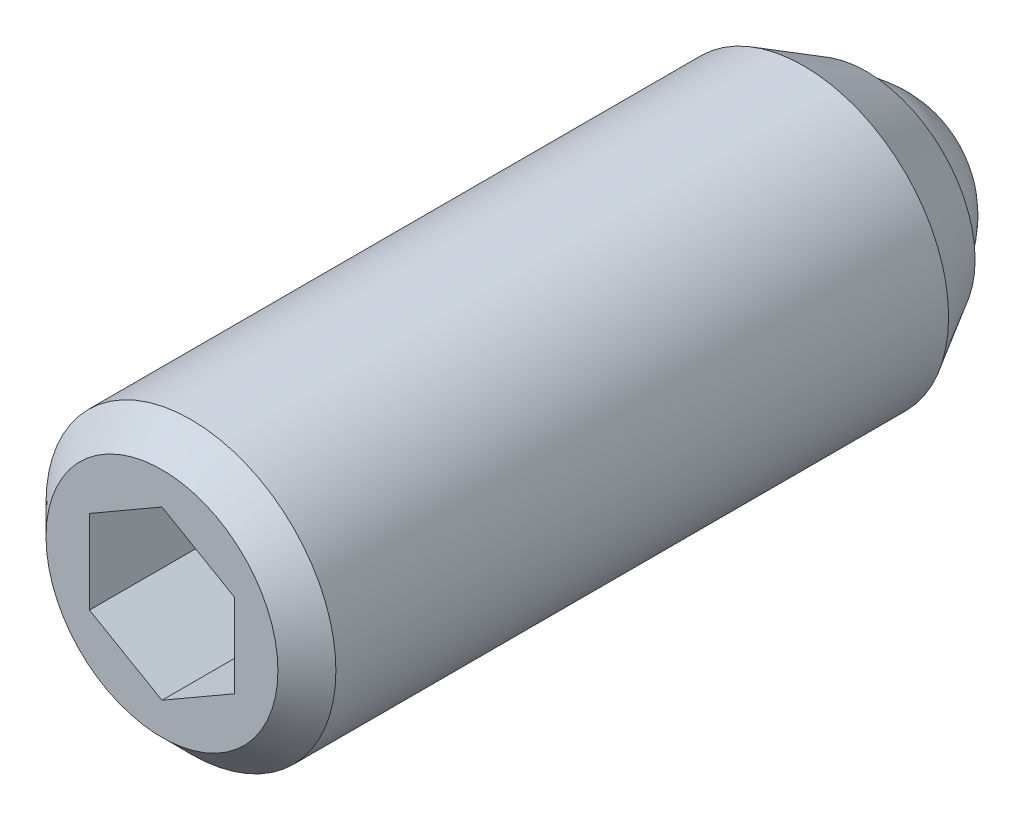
ISO-10303-21;
HEADER;
FILE_DESCRIPTION(('STEP AP214'),'2;1');
FILE_NAME('part.step','',(''),(''),'','','');
FILE_SCHEMA(('AUTOMOTIVE_DESIGN { 1 0 10303 214 1 1 1 1 }'));
ENDSEC;
DATA;
#1=APPLICATION_CONTEXT('core data for automotive mechanical design processes');
#2=APPLICATION_PROTOCOL_DEFINITION('international standard','automotive_design',2000,#1);
#3=PRODUCT_CONTEXT('',#1,'mechanical');
#4=PRODUCT('Part','Part','',(#3));
#5=PRODUCT_RELATED_PRODUCT_CATEGORY('part','',(#4));
#6=PRODUCT_DEFINITION_FORMATION('','',#4);
#7=PRODUCT_DEFINITION_CONTEXT('part definition',#1,'design');
#8=PRODUCT_DEFINITION('design','',#6,#7);
#9=PRODUCT_DEFINITION_SHAPE('','',#8);
#10=(LENGTH_UNIT() NAMED_UNIT(*) SI_UNIT(.MILLI.,.METRE.));
#11=(NAMED_UNIT(*) PLANE_ANGLE_UNIT() SI_UNIT($,.RADIAN.));
#12=(NAMED_UNIT(*) SI_UNIT($,.STERADIAN.) SOLID_ANGLE_UNIT());
#13=UNCERTAINTY_MEASURE_WITH_UNIT(LENGTH_MEASURE(1.E-05),#10,'distance_accuracy_value','');
#14=(GEOMETRIC_REPRESENTATION_CONTEXT(3) GLOBAL_UNCERTAINTY_ASSIGNED_CONTEXT((#13)) GLOBAL_UNIT_ASSIGNED_CONTEXT((#10,
#11,#12)) REPRESENTATION_CONTEXT('',''));
#15=CARTESIAN_POINT('',(0.,0.,0.));
#16=DIRECTION('',(0.,0.,1.));
#17=DIRECTION('',(1.,0.,0.));
#18=AXIS2_PLACEMENT_3D('',#15,#16,#17);
#19=CARTESIAN_POINT('',(2.5,1.44337567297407,24.2));
#20=DIRECTION('',(0.5,0.86602540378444,0.));
#21=DIRECTION('',(0.86602540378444,-0.5,0.));
#22=AXIS2_PLACEMENT_3D('',#19,#20,#21);
#23=PLANE('',#22);
#24=DIRECTION('',(0.,0.,1.));
#25=VECTOR('',#24,1.);
#26=CARTESIAN_POINT('',(2.5,1.44337567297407,24.2));
#27=LINE('',#26,#25);
#28=CARTESIAN_POINT('',(2.5,1.44337567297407,22.7));
#29=VERTEX_POINT('',#28);
#30=CARTESIAN_POINT('',(2.5,1.44337567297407,26.7));
#31=VERTEX_POINT('',#30);
#32=EDGE_CURVE('E68',#29,#31,#27,.T.);
#33=ORIENTED_EDGE('',*,*,#32,.T.);
#34=DIRECTION('',(-0.86602540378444,0.5,0.));
#35=VECTOR('',#34,1.);
#36=CARTESIAN_POINT('',(2.5,1.44337567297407,26.7));
#37=LINE('',#36,#35);
#38=CARTESIAN_POINT('',(0.,2.88675134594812,26.7));
#39=VERTEX_POINT('',#38);
#40=EDGE_CURVE('E29',#31,#39,#37,.T.);
#41=ORIENTED_EDGE('',*,*,#40,.T.);
#42=DIRECTION('',(0.,0.,1.));
#43=VECTOR('',#42,1.);
#44=CARTESIAN_POINT('',(0.,2.88675134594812,24.2));
#45=LINE('',#44,#43);
#46=CARTESIAN_POINT('',(0.,2.88675134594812,22.7));
#47=VERTEX_POINT('',#46);
#48=EDGE_CURVE('E80',#47,#39,#45,.T.);
#49=ORIENTED_EDGE('',*,*,#48,.F.);
#50=DIRECTION('',(-0.86602540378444,0.5,0.));
#51=VECTOR('',#50,1.);
#52=CARTESIAN_POINT('',(2.5,1.44337567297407,22.7));
#53=LINE('',#52,#51);
#54=EDGE_CURVE('E79',#29,#47,#53,.T.);
#55=ORIENTED_EDGE('',*,*,#54,.F.);
#56=EDGE_LOOP('',(#33,#41,#49,#55));
#57=FACE_BOUND('',#56,.T.);
#58=ADVANCED_FACE('F14',(#57),#23,.F.);
#59=CARTESIAN_POINT('',(2.5,-1.44337567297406,24.2));
#60=DIRECTION('',(1.,0.,0.));
#61=DIRECTION('',(0.,-1.,0.));
#62=AXIS2_PLACEMENT_3D('',#59,#60,#61);
#63=PLANE('',#62);
#64=DIRECTION('',(0.,0.,1.));
#65=VECTOR('',#64,1.);
#66=CARTESIAN_POINT('',(2.5,-1.44337567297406,24.2));
#67=LINE('',#66,#65);
#68=CARTESIAN_POINT('',(2.5,-1.44337567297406,22.7));
#69=VERTEX_POINT('',#68);
#70=CARTESIAN_POINT('',(2.5,-1.44337567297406,26.7));
#71=VERTEX_POINT('',#70);
#72=EDGE_CURVE('E76',#69,#71,#67,.T.);
#73=ORIENTED_EDGE('',*,*,#72,.T.);
#74=DIRECTION('',(0.,1.,0.));
#75=VECTOR('',#74,1.);
#76=CARTESIAN_POINT('',(2.5,-1.44337567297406,26.7));
#77=LINE('',#76,#75);
#78=EDGE_CURVE('E75',#71,#31,#77,.T.);
#79=ORIENTED_EDGE('',*,*,#78,.T.);
#80=ORIENTED_EDGE('',*,*,#32,.F.);
#81=DIRECTION('',(0.,1.,0.));
#82=VECTOR('',#81,1.);
#83=CARTESIAN_POINT('',(2.5,-1.44337567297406,22.7));
#84=LINE('',#83,#82);
#85=EDGE_CURVE('E72',#69,#29,#84,.T.);
#86=ORIENTED_EDGE('',*,*,#85,.F.);
#87=EDGE_LOOP('',(#73,#79,#80,#86));
#88=FACE_BOUND('',#87,.T.);
#89=ADVANCED_FACE('F70',(#88),#63,.F.);
#90=CARTESIAN_POINT('',(2.5,-1.44337567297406,24.2));
#91=DIRECTION('',(-0.5,0.866025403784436,0.));
#92=DIRECTION('',(0.866025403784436,0.5,0.));
#93=AXIS2_PLACEMENT_3D('',#90,#91,#92);
#94=PLANE('',#93);
#95=DIRECTION('',(0.,0.,1.));
#96=VECTOR('',#95,1.);
#97=CARTESIAN_POINT('',(0.,-2.88675134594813,24.2));
#98=LINE('',#97,#96);
#99=CARTESIAN_POINT('',(0.,-2.88675134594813,22.7));
#100=VERTEX_POINT('',#99);
#101=CARTESIAN_POINT('',(0.,-2.88675134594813,26.7));
#102=VERTEX_POINT('',#101);
#103=EDGE_CURVE('E122',#100,#102,#98,.T.);
#104=ORIENTED_EDGE('',*,*,#103,.T.);
#105=DIRECTION('',(-0.866025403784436,-0.5,0.));
#106=VECTOR('',#105,1.);
#107=CARTESIAN_POINT('',(2.5,-1.44337567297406,26.7));
#108=LINE('',#107,#106);
#109=EDGE_CURVE('E113',#71,#102,#108,.T.);
#110=ORIENTED_EDGE('',*,*,#109,.F.);
#111=ORIENTED_EDGE('',*,*,#72,.F.);
#112=DIRECTION('',(0.866025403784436,0.5,0.));
#113=VECTOR('',#112,1.);
#114=CARTESIAN_POINT('',(0.,-2.88675134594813,22.7));
#115=LINE('',#114,#113);
#116=EDGE_CURVE('E89',#100,#69,#115,.T.);
#117=ORIENTED_EDGE('',*,*,#116,.F.);
#118=EDGE_LOOP('',(#104,#110,#111,#117));
#119=FACE_BOUND('',#118,.T.);
#120=ADVANCED_FACE('F147',(#119),#94,.T.);
#121=CARTESIAN_POINT('',(-2.5,-1.44337567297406,24.2));
#122=DIRECTION('',(-0.5,-0.866025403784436,0.));
#123=DIRECTION('',(-0.866025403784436,0.5,0.));
#124=AXIS2_PLACEMENT_3D('',#121,#122,#123);
#125=PLANE('',#124);
#126=DIRECTION('',(0.,0.,1.));
#127=VECTOR('',#126,1.);
#128=CARTESIAN_POINT('',(-2.5,-1.44337567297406,24.2));
#129=LINE('',#128,#127);
#130=CARTESIAN_POINT('',(-2.5,-1.44337567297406,22.7));
#131=VERTEX_POINT('',#130);
#132=CARTESIAN_POINT('',(-2.5,-1.44337567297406,26.7));
#133=VERTEX_POINT('',#132);
#134=EDGE_CURVE('E120',#131,#133,#129,.T.);
#135=ORIENTED_EDGE('',*,*,#134,.T.);
#136=DIRECTION('',(0.866025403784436,-0.5,0.));
#137=VECTOR('',#136,1.);
#138=CARTESIAN_POINT('',(-2.5,-1.44337567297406,26.7));
#139=LINE('',#138,#137);
#140=EDGE_CURVE('E111',#133,#102,#139,.T.);
#141=ORIENTED_EDGE('',*,*,#140,.T.);
#142=ORIENTED_EDGE('',*,*,#103,.F.);
#143=DIRECTION('',(0.866025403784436,-0.5,0.));
#144=VECTOR('',#143,1.);
#145=CARTESIAN_POINT('',(-2.5,-1.44337567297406,22.7));
#146=LINE('',#145,#144);
#147=EDGE_CURVE('E101',#131,#100,#146,.T.);
#148=ORIENTED_EDGE('',*,*,#147,.F.);
#149=EDGE_LOOP('',(#135,#141,#142,#148));
#150=FACE_BOUND('',#149,.T.);
#151=ADVANCED_FACE('F157',(#150),#125,.F.);
#152=CARTESIAN_POINT('',(-2.5,-1.44337567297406,24.2));
#153=DIRECTION('',(1.,0.,0.));
#154=DIRECTION('',(0.,-1.,0.));
#155=AXIS2_PLACEMENT_3D('',#152,#153,#154);
#156=PLANE('',#155);
#157=DIRECTION('',(0.,0.,1.));
#158=VECTOR('',#157,1.);
#159=CARTESIAN_POINT('',(-2.5,1.44337567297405,24.2));
#160=LINE('',#159,#158);
#161=CARTESIAN_POINT('',(-2.5,1.44337567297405,22.7));
#162=VERTEX_POINT('',#161);
#163=CARTESIAN_POINT('',(-2.5,1.44337567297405,26.7));
#164=VERTEX_POINT('',#163);
#165=EDGE_CURVE('E37',#162,#164,#160,.T.);
#166=ORIENTED_EDGE('',*,*,#165,.T.);
#167=DIRECTION('',(0.,1.,0.));
#168=VECTOR('',#167,1.);
#169=CARTESIAN_POINT('',(-2.5,-1.44337567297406,26.7));
#170=LINE('',#169,#168);
#171=EDGE_CURVE('E108',#133,#164,#170,.T.);
#172=ORIENTED_EDGE('',*,*,#171,.F.);
#173=ORIENTED_EDGE('',*,*,#134,.F.);
#174=DIRECTION('',(0.,-1.,0.));
#175=VECTOR('',#174,1.);
#176=CARTESIAN_POINT('',(-2.5,1.44337567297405,22.7));
#177=LINE('',#176,#175);
#178=EDGE_CURVE('E98',#162,#131,#177,.T.);
#179=ORIENTED_EDGE('',*,*,#178,.F.);
#180=EDGE_LOOP('',(#166,#172,#173,#179));
#181=FACE_BOUND('',#180,.T.);
#182=ADVANCED_FACE('F153',(#181),#156,.T.);
#183=CARTESIAN_POINT('',(-2.5,1.44337567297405,24.2));
#184=DIRECTION('',(0.5,-0.866025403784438,0.));
#185=DIRECTION('',(-0.866025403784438,-0.5,0.));
#186=AXIS2_PLACEMENT_3D('',#183,#184,#185);
#187=PLANE('',#186);
#188=ORIENTED_EDGE('',*,*,#165,.F.);
#189=DIRECTION('',(-0.866025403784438,-0.5,0.));
#190=VECTOR('',#189,1.);
#191=CARTESIAN_POINT('',(0.,2.88675134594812,22.7));
#192=LINE('',#191,#190);
#193=EDGE_CURVE('E84',#47,#162,#192,.T.);
#194=ORIENTED_EDGE('',*,*,#193,.F.);
#195=ORIENTED_EDGE('',*,*,#48,.T.);
#196=DIRECTION('',(0.866025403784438,0.5,0.));
#197=VECTOR('',#196,1.);
#198=CARTESIAN_POINT('',(-2.5,1.44337567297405,26.7));
#199=LINE('',#198,#197);
#200=EDGE_CURVE('E105',#164,#39,#199,.T.);
#201=ORIENTED_EDGE('',*,*,#200,.F.);
#202=EDGE_LOOP('',(#188,#194,#195,#201));
#203=FACE_BOUND('',#202,.T.);
#204=ADVANCED_FACE('F150',(#203),#187,.T.);
#205=CARTESIAN_POINT('',(0.,0.,26.45));
#206=DIRECTION('',(0.,0.,-1.));
#207=DIRECTION('',(1.,0.,0.));
#208=AXIS2_PLACEMENT_3D('',#205,#206,#207);
#209=CYLINDRICAL_SURFACE('',#208,5.);
#210=CARTESIAN_POINT('',(0.,0.,25.7));
#211=DIRECTION('',(0.,0.,-1.));
#212=DIRECTION('',(1.,0.,0.));
#213=AXIS2_PLACEMENT_3D('',#210,#211,#212);
#214=CIRCLE('',#213,5.);
#215=CARTESIAN_POINT('',(5.,0.,25.7));
#216=VERTEX_POINT('',#215);
#217=EDGE_CURVE('E9',#216,#216,#214,.T.);
#218=ORIENTED_EDGE('',*,*,#217,.T.);
#219=EDGE_LOOP('',(#218));
#220=FACE_BOUND('',#219,.T.);
#221=CARTESIAN_POINT('',(0.,0.,4.56506350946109));
#222=DIRECTION('',(0.,0.,-1.));
#223=DIRECTION('',(-1.,0.,0.));
#224=AXIS2_PLACEMENT_3D('',#221,#222,#223);
#225=CIRCLE('',#224,5.);
#226=CARTESIAN_POINT('',(-5.,0.,4.56506350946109));
#227=VERTEX_POINT('',#226);
#228=EDGE_CURVE('E244',#227,#227,#225,.T.);
#229=ORIENTED_EDGE('',*,*,#228,.F.);
#230=EDGE_LOOP('',(#229));
#231=FACE_BOUND('',#230,.T.);
#232=ADVANCED_FACE('F16',(#220,#231),#209,.T.);
#233=CARTESIAN_POINT('',(0.,0.,25.7));
#234=DIRECTION('',(0.,0.,-1.));
#235=DIRECTION('',(1.,0.,0.));
#236=AXIS2_PLACEMENT_3D('',#233,#234,#235);
#237=CONICAL_SURFACE('',#236,5.,0.785398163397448);
#238=CARTESIAN_POINT('',(0.,0.,26.7));
#239=DIRECTION('',(0.,0.,-1.));
#240=DIRECTION('',(1.,0.,0.));
#241=AXIS2_PLACEMENT_3D('',#238,#239,#240);
#242=CIRCLE('',#241,4.);
#243=CARTESIAN_POINT('',(4.,0.,26.7));
#244=VERTEX_POINT('',#243);
#245=EDGE_CURVE('E22',#244,#244,#242,.T.);
#246=ORIENTED_EDGE('',*,*,#245,.T.);
#247=EDGE_LOOP('',(#246));
#248=FACE_BOUND('',#247,.T.);
#249=ORIENTED_EDGE('',*,*,#217,.F.);
#250=EDGE_LOOP('',(#249));
#251=FACE_BOUND('',#250,.T.);
#252=ADVANCED_FACE('F127',(#248,#251),#237,.T.);
#253=CARTESIAN_POINT('',(0.,0.,26.7));
#254=DIRECTION('',(0.,0.,-1.));
#255=DIRECTION('',(1.,0.,0.));
#256=AXIS2_PLACEMENT_3D('',#253,#254,#255);
#257=PLANE('',#256);
#258=ORIENTED_EDGE('',*,*,#200,.T.);
#259=ORIENTED_EDGE('',*,*,#40,.F.);
#260=ORIENTED_EDGE('',*,*,#78,.F.);
#261=ORIENTED_EDGE('',*,*,#109,.T.);
#262=ORIENTED_EDGE('',*,*,#140,.F.);
#263=ORIENTED_EDGE('',*,*,#171,.T.);
#264=EDGE_LOOP('',(#258,#259,#260,#261,#262,#263));
#265=FACE_BOUND('',#264,.T.);
#266=ORIENTED_EDGE('',*,*,#245,.F.);
#267=EDGE_LOOP('',(#266));
#268=FACE_BOUND('',#267,.T.);
#269=ADVANCED_FACE('F130',(#265,#268),#257,.F.);
#270=CARTESIAN_POINT('',(2.5,1.44337567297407,22.7));
#271=DIRECTION('',(0.,0.,1.));
#272=DIRECTION('',(1.,0.,0.));
#273=AXIS2_PLACEMENT_3D('',#270,#271,#272);
#274=PLANE('',#273);
#275=ORIENTED_EDGE('',*,*,#85,.T.);
#276=ORIENTED_EDGE('',*,*,#54,.T.);
#277=ORIENTED_EDGE('',*,*,#193,.T.);
#278=ORIENTED_EDGE('',*,*,#178,.T.);
#279=ORIENTED_EDGE('',*,*,#147,.T.);
#280=ORIENTED_EDGE('',*,*,#116,.T.);
#281=EDGE_LOOP('',(#275,#276,#277,#278,#279,#280));
#282=FACE_BOUND('',#281,.T.);
#283=ADVANCED_FACE('F86',(#282),#274,.T.);
#284=CARTESIAN_POINT('',(0.,0.,3.5));
#285=DIRECTION('',(0.,0.,-1.));
#286=DIRECTION('',(-1.,0.,0.));
#287=AXIS2_PLACEMENT_3D('',#284,#285,#286);
#288=SPHERICAL_SURFACE('',#287,3.5);
#289=CARTESIAN_POINT('',(0.,0.,2.4));
#290=DIRECTION('',(0.,0.,-1.));
#291=DIRECTION('',(-1.,0.,0.));
#292=AXIS2_PLACEMENT_3D('',#289,#290,#291);
#293=CIRCLE('',#292,3.32264954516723);
#294=CARTESIAN_POINT('',(-3.32264954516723,0.,2.4));
#295=VERTEX_POINT('',#294);
#296=EDGE_CURVE('E90',#295,#295,#293,.T.);
#297=ORIENTED_EDGE('',*,*,#296,.T.);
#298=EDGE_LOOP('',(#297));
#299=FACE_BOUND('',#298,.T.);
#300=ADVANCED_FACE('F139',(#299),#288,.T.);
#301=CARTESIAN_POINT('',(-3.32264954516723,0.,2.4));
#302=DIRECTION('',(0.,0.,-1.));
#303=DIRECTION('',(-1.,0.,0.));
#304=AXIS2_PLACEMENT_3D('',#301,#302,#303);
#305=PLANE('',#304);
#306=CARTESIAN_POINT('',(0.,0.,2.4));
#307=DIRECTION('',(0.,0.,-1.));
#308=DIRECTION('',(-1.,0.,0.));
#309=AXIS2_PLACEMENT_3D('',#306,#307,#308);
#310=CIRCLE('',#309,3.75);
#311=CARTESIAN_POINT('',(-3.75,0.,2.4));
#312=VERTEX_POINT('',#311);
#313=EDGE_CURVE('E93',#312,#312,#310,.T.);
#314=ORIENTED_EDGE('',*,*,#313,.T.);
#315=EDGE_LOOP('',(#314));
#316=FACE_BOUND('',#315,.T.);
#317=ORIENTED_EDGE('',*,*,#296,.F.);
#318=EDGE_LOOP('',(#317));
#319=FACE_BOUND('',#318,.T.);
#320=ADVANCED_FACE('F216',(#316,#319),#305,.T.);
#321=CARTESIAN_POINT('',(0.,0.,2.4));
#322=DIRECTION('',(0.,0.,1.));
#323=DIRECTION('',(1.,0.,0.));
#324=AXIS2_PLACEMENT_3D('',#321,#322,#323);
#325=CONICAL_SURFACE('',#324,3.75,0.523598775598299);
#326=ORIENTED_EDGE('',*,*,#228,.T.);
#327=EDGE_LOOP('',(#326));
#328=FACE_BOUND('',#327,.T.);
#329=ORIENTED_EDGE('',*,*,#313,.F.);
#330=EDGE_LOOP('',(#329));
#331=FACE_BOUND('',#330,.T.);
#332=ADVANCED_FACE('F225',(#328,#331),#325,.T.);
#333=CLOSED_SHELL('',(#58,#89,#120,#151,#182,#204,#232,#252,#269,#283,#300,#320,#332));
#334=MANIFOLD_SOLID_BREP('B1',#333);
#335=ADVANCED_BREP_SHAPE_REPRESENTATION('',(#18,#334),#14);
#336=SHAPE_DEFINITION_REPRESENTATION(#9,#335);
ENDSEC;
END-ISO-10303-21;
